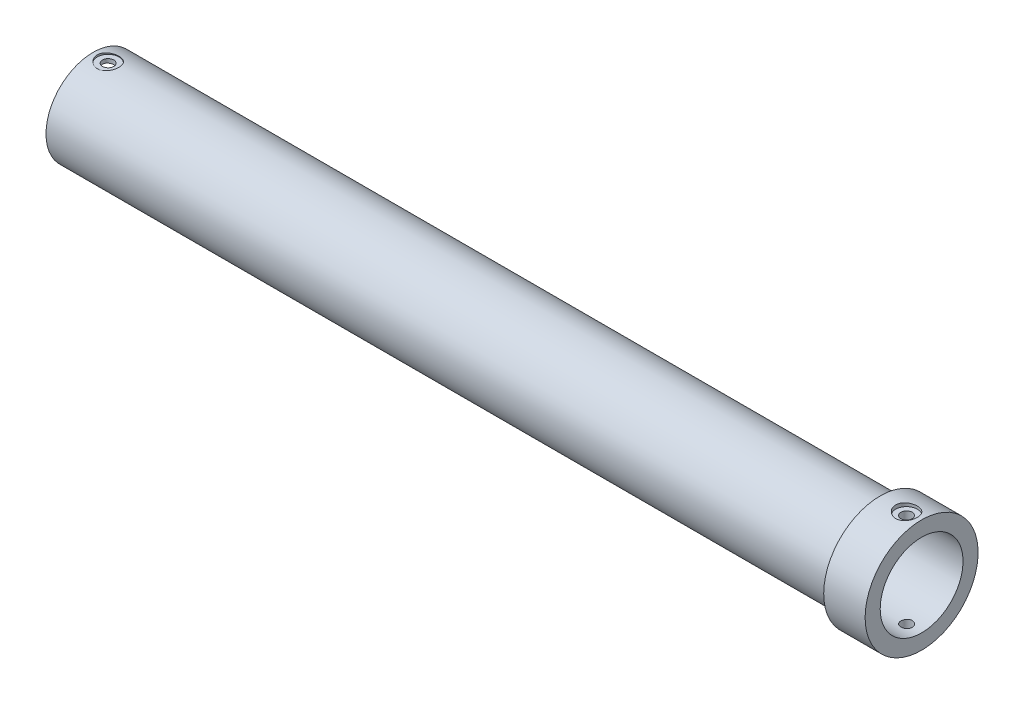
from build123d import *

# Parameters (mm, degrees)
SKETCH2_R          = 1.5
CUT_EXTRUDE1_DEPTH = 12
SKETCH4_R          = 2.875
CUT_EXTRUDE3_DEPTH = 1
CIRPATTERN1_COUNT  = 2
SKETCH7_R          = 1.5
CUT_EXTRUDE6_DEPTH = 10
CIRPATTERN3_COUNT  = 2
SKETCH8_R          = 2.875
CUT_EXTRUDE7_DEPTH = 0.5
CIRPATTERN4_COUNT  = 2
SKETCH9_R          = 1.25
CUT_EXTRUDE8_DEPTH = 10
CIRPATTERN5_COUNT  = 3


with BuildPart() as part:
    # Sketch1 → Base-Revolve (revolve)
    with BuildSketch(Plane.XY, mode=Mode.PRIVATE) as base_revolve_sk:
        Polygon((0, 11), (153, 11), (153, 5), (155, 5), (155, 11), (220, 11), (220, 15), (209, 15), (209, 13), (208.133974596, 12.5), (0, 12.5), align=None)
    revolve(base_revolve_sk.sketch.rotate(Axis((0, 0, 0), (1, 0, 0)), 90), axis=Axis((0, 0, 0), (1, 0, 0)))

    # Sketch2 → Cut-Extrude1 (cut)
    with BuildSketch(Plane(origin=(0, 15, 0), x_dir=(-1, 0, 0), z_dir=(0, 1, 0))):
        with Locations(Location((-216, 0, 0), (0, 0, 90))):
            Circle(SKETCH2_R)
    cut_extrude1 = extrude(amount=-CUT_EXTRUDE1_DEPTH, mode=Mode.SUBTRACT)

    # Sketch4 → Cut-Extrude3 (cut)
    with BuildSketch(Plane(origin=(0, 15, 0), x_dir=(-1, 0, 0), z_dir=(0, 1, 0))):
        with Locations(Location((-216, 0, 0), (0, 0, 90))):
            Circle(SKETCH4_R)
    cut_extrude3 = extrude(amount=-CUT_EXTRUDE3_DEPTH, mode=Mode.SUBTRACT)

    # CirPattern1: Cut-Extrude1, Cut-Extrude3 ×2 about axis
    cirpattern1_axis = Axis((0, 0, 0), (1, 0, 0))
    add([cut_extrude1.rotate(cirpattern1_axis, i * 360 / CIRPATTERN1_COUNT) for i in range(1, CIRPATTERN1_COUNT)], mode=Mode.SUBTRACT)
    add([cut_extrude3.rotate(cirpattern1_axis, i * 360 / CIRPATTERN1_COUNT) for i in range(1, CIRPATTERN1_COUNT)], mode=Mode.SUBTRACT)

    # Sketch7 → Cut-Extrude6 (cut)
    with BuildSketch(Plane(origin=(0, 15, 0), x_dir=(-1, 0, 0), z_dir=(0, 1, 0))):
        with Locations(Location((-4, 0, 0), (0, 0, 90))):
            Circle(SKETCH7_R)
    cut_extrude6 = extrude(amount=-CUT_EXTRUDE6_DEPTH, mode=Mode.SUBTRACT)

    # CirPattern3: Cut-Extrude6 ×2 about axis
    cirpattern3_axis = Axis((0, 0, 0), (1, 0, 0))
    for i in range(1, CIRPATTERN3_COUNT):
        add(cut_extrude6.rotate(cirpattern3_axis, i * 360 / CIRPATTERN3_COUNT), mode=Mode.SUBTRACT)

    # Sketch8 → Cut-Extrude7 (cut)
    with BuildSketch(Plane(origin=(0, 12.5, 0), x_dir=(-1, 0, 0), z_dir=(0, 1, 0))):
        with Locations(Location((-4, 0, 0), (0, 0, 90))):
            Circle(SKETCH8_R)
    cut_extrude7 = extrude(amount=-CUT_EXTRUDE7_DEPTH, mode=Mode.SUBTRACT)

    # CirPattern4: Cut-Extrude7 ×2 about axis
    cirpattern4_axis = Axis((0, 0, 0), (1, 0, 0))
    for i in range(1, CIRPATTERN4_COUNT):
        add(cut_extrude7.rotate(cirpattern4_axis, i * 360 / CIRPATTERN4_COUNT), mode=Mode.SUBTRACT)

    # Sketch9 → Cut-Extrude8 (cut)
    with BuildSketch(Plane(origin=(155, 0, 0), x_dir=(0, 0, -1), z_dir=(1, 0, 0))):
        with Locations((0, 7)):
            Circle(SKETCH9_R)
    cut_extrude8 = extrude(amount=-CUT_EXTRUDE8_DEPTH, mode=Mode.SUBTRACT)

    # CirPattern5: Cut-Extrude8 ×3 about axis
    cirpattern5_axis = Axis((0, 0, 0), (1, 0, 0))
    for i in range(1, CIRPATTERN5_COUNT):
        add(cut_extrude8.rotate(cirpattern5_axis, i * 360 / CIRPATTERN5_COUNT), mode=Mode.SUBTRACT)


solid = part.part
